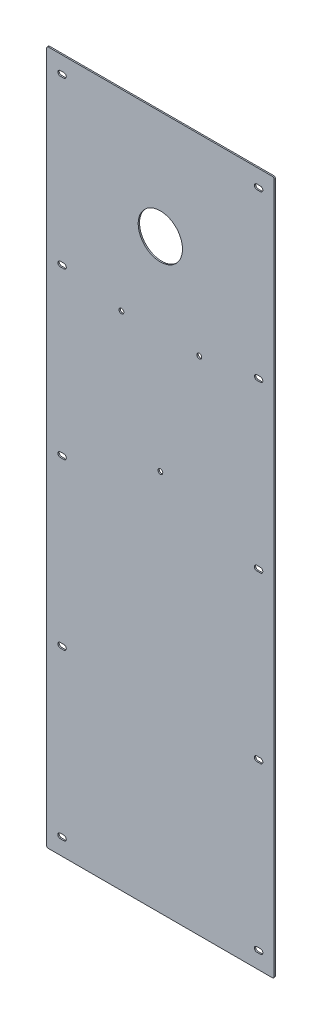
from build123d import *

# Parameters (mm, degrees)
SKIZZE1_W                       = 257
SKIZZE1_H                       = 784
AUFSATZ_LINEAR_AUSTRAGEN1_DEPTH = 1.5
DURCHGANGSLOCH_F_R_M51_D        = 5.5
SCHNITT_LINEAR_AUSTRAGEN6_DEPTH = 413.526968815
VERRUNDUNG2_R                   = 2
SKIZZE7_R                       = 25
SCHNITT_LINEAR_AUSTRAGEN4_DEPTH = 413.526968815
DURCHGANGSLOCH_F_R_M52_D        = 5.5


with BuildPart() as part:
    # Skizze1 → Aufsatz-Linear austragen1 (new body)
    with BuildSketch(Plane.XY):
        Rectangle(SKIZZE1_W, SKIZZE1_H)
    extrude(amount=AUFSATZ_LINEAR_AUSTRAGEN1_DEPTH)

    # Durchgangsloch f_r M51 (through all)
    with Locations(Plane.XY.offset(1.5)):
        with Locations((-111, 373), (-111, 0), (-111, -373), (111, -373), (111, 0), (111, 373), (-111, -186.5), (111, -186.5), (-111, 186.5), (111, 186.5)):
            Hole(DURCHGANGSLOCH_F_R_M51_D / 2)

    # Skizze13 → Schnitt-Linear austragen6 (cut, through all)
    with BuildSketch(Plane.XY.offset(1.5)):
        with BuildLine():
            Line((-113, 375.75), (-109, 375.75))
            ThreePointArc((-109, 375.75), (-106.25, 373), (-109, 370.25))
            Line((-109, 370.25), (-113, 370.25))
            ThreePointArc((-113, 370.25), (-115.75, 373), (-113, 375.75))
        make_face()
        with BuildLine():
            Line((-113, 189.25), (-109, 189.25))
            ThreePointArc((-109, 189.25), (-106.25, 186.5), (-109, 183.75))
            Line((-109, 183.75), (-113, 183.75))
            ThreePointArc((-113, 183.75), (-115.75, 186.5), (-113, 189.25))
        make_face()
        with BuildLine():
            Line((-113, 2.75), (-109, 2.75))
            ThreePointArc((-109, 2.75), (-106.25, 0), (-109, -2.75))
            Line((-109, -2.75), (-113, -2.75))
            ThreePointArc((-113, -2.75), (-115.75, 0), (-113, 2.75))
        make_face()
        with BuildLine():
            Line((-113, -183.75), (-109, -183.75))
            ThreePointArc((-109, -183.75), (-106.25, -186.5), (-109, -189.25))
            Line((-109, -189.25), (-113, -189.25))
            ThreePointArc((-113, -189.25), (-115.75, -186.5), (-113, -183.75))
        make_face()
        with BuildLine():
            Line((-113, -370.25), (-109, -370.25))
            ThreePointArc((-109, -370.25), (-106.25, -373), (-109, -375.75))
            Line((-109, -375.75), (-113, -375.75))
            ThreePointArc((-113, -375.75), (-115.75, -373), (-113, -370.25))
        make_face()
        with BuildLine():
            Line((113, 375.75), (109, 375.75))
            ThreePointArc((109, 375.75), (106.25, 373), (109, 370.25))
            Line((109, 370.25), (113, 370.25))
            ThreePointArc((113, 370.25), (115.75, 373), (113, 375.75))
        make_face()
        with BuildLine():
            Line((113, 189.25), (109, 189.25))
            ThreePointArc((109, 189.25), (106.25, 186.5), (109, 183.75))
            Line((109, 183.75), (113, 183.75))
            ThreePointArc((113, 183.75), (115.75, 186.5), (113, 189.25))
        make_face()
        with BuildLine():
            Line((113, 2.75), (109, 2.75))
            ThreePointArc((109, 2.75), (106.25, 0), (109, -2.75))
            Line((109, -2.75), (113, -2.75))
            ThreePointArc((113, -2.75), (115.75, 0), (113, 2.75))
        make_face()
        with BuildLine():
            Line((113, -183.75), (109, -183.75))
            ThreePointArc((109, -183.75), (106.25, -186.5), (109, -189.25))
            Line((109, -189.25), (113, -189.25))
            ThreePointArc((113, -189.25), (115.75, -186.5), (113, -183.75))
        make_face()
        with BuildLine():
            Line((113, -370.25), (109, -370.25))
            ThreePointArc((109, -370.25), (106.25, -373), (109, -375.75))
            Line((109, -375.75), (113, -375.75))
            ThreePointArc((113, -375.75), (115.75, -373), (113, -370.25))
        make_face()
    extrude(amount=-SCHNITT_LINEAR_AUSTRAGEN6_DEPTH, mode=Mode.SUBTRACT)

    # Verrundung2
    verrundung2_edges = [part.edges().sort_by_distance(p)[0] for p in [
        (128.5, -392, 0.75),
        (-128.5, -392, 0.75),
        (-128.5, 392, 0.75),
        (128.5, 392, 0.75),
    ]]
    fillet(verrundung2_edges, radius=VERRUNDUNG2_R)

    # Skizze7 → Schnitt-Linear austragen4 (cut, through all)
    with BuildSketch(Plane.XY.offset(1.5)):
        with Locations((0, 270)):
            Circle(SKIZZE7_R)
    extrude(amount=-SCHNITT_LINEAR_AUSTRAGEN4_DEPTH, mode=Mode.SUBTRACT)

    # Durchgangsloch f_r M52 (through all)
    with Locations(Plane.XY.offset(1.5)):
        with Locations((-44, 175), (0, 40), (44, 175)):
            Hole(DURCHGANGSLOCH_F_R_M52_D / 2)


solid = part.part
